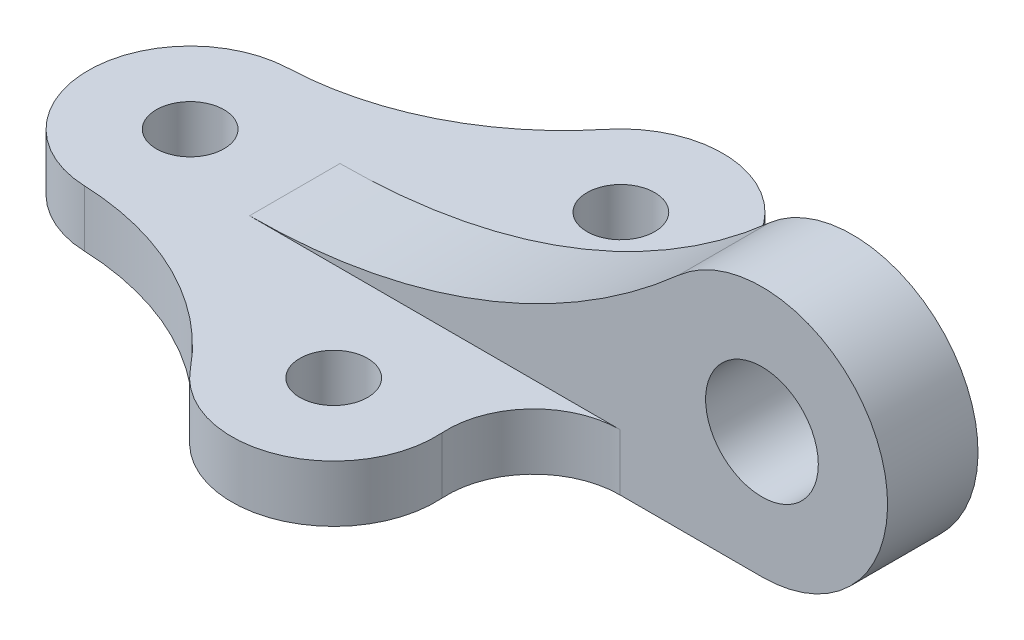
ISO-10303-21;
HEADER;
FILE_DESCRIPTION(('STEP AP214'),'2;1');
FILE_NAME('part.step','',(''),(''),'','','');
FILE_SCHEMA(('AUTOMOTIVE_DESIGN { 1 0 10303 214 1 1 1 1 }'));
ENDSEC;
DATA;
#1=APPLICATION_CONTEXT('core data for automotive mechanical design processes');
#2=APPLICATION_PROTOCOL_DEFINITION('international standard','automotive_design',2000,#1);
#3=PRODUCT_CONTEXT('',#1,'mechanical');
#4=PRODUCT('Part','Part','',(#3));
#5=PRODUCT_RELATED_PRODUCT_CATEGORY('part','',(#4));
#6=PRODUCT_DEFINITION_FORMATION('','',#4);
#7=PRODUCT_DEFINITION_CONTEXT('part definition',#1,'design');
#8=PRODUCT_DEFINITION('design','',#6,#7);
#9=PRODUCT_DEFINITION_SHAPE('','',#8);
#10=(LENGTH_UNIT() NAMED_UNIT(*) SI_UNIT(.MILLI.,.METRE.));
#11=(NAMED_UNIT(*) PLANE_ANGLE_UNIT() SI_UNIT($,.RADIAN.));
#12=(NAMED_UNIT(*) SI_UNIT($,.STERADIAN.) SOLID_ANGLE_UNIT());
#13=UNCERTAINTY_MEASURE_WITH_UNIT(LENGTH_MEASURE(1.E-05),#10,'distance_accuracy_value','');
#14=(GEOMETRIC_REPRESENTATION_CONTEXT(3) GLOBAL_UNCERTAINTY_ASSIGNED_CONTEXT((#13)) GLOBAL_UNIT_ASSIGNED_CONTEXT((#10,
#11,#12)) REPRESENTATION_CONTEXT('',''));
#15=CARTESIAN_POINT('',(0.,0.,0.));
#16=DIRECTION('',(0.,0.,1.));
#17=DIRECTION('',(1.,0.,0.));
#18=AXIS2_PLACEMENT_3D('',#15,#16,#17);
#19=CARTESIAN_POINT('',(-2.64164601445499,10.0076,-68.78329202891));
#20=DIRECTION('',(0.,1.,0.));
#21=DIRECTION('',(0.,0.,1.));
#22=AXIS2_PLACEMENT_3D('',#19,#20,#21);
#23=PLANE('',#22);
#24=DIRECTION('',(1.,0.,0.));
#25=VECTOR('',#24,1.);
#26=CARTESIAN_POINT('',(-2.64164601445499,10.0076,8.00099999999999));
#27=LINE('',#26,#25);
#28=CARTESIAN_POINT('',(18.5085183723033,10.0076,8.001));
#29=VERTEX_POINT('',#28);
#30=CARTESIAN_POINT('',(84.0038822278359,10.0076,8.001));
#31=VERTEX_POINT('',#30);
#32=EDGE_CURVE('E193',#29,#31,#27,.T.);
#33=ORIENTED_EDGE('',*,*,#32,.F.);
#34=DIRECTION('',(0.,0.,-1.));
#35=VECTOR('',#34,1.);
#36=CARTESIAN_POINT('',(18.5085183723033,10.0076,8.001));
#37=LINE('',#36,#35);
#38=CARTESIAN_POINT('',(18.5085183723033,10.0076,-8.001));
#39=VERTEX_POINT('',#38);
#40=EDGE_CURVE('E203',#29,#39,#37,.T.);
#41=ORIENTED_EDGE('',*,*,#40,.T.);
#42=DIRECTION('',(1.,0.,0.));
#43=VECTOR('',#42,1.);
#44=CARTESIAN_POINT('',(-2.64164601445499,10.0076,-8.001));
#45=LINE('',#44,#43);
#46=CARTESIAN_POINT('',(84.0038822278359,10.0076,-8.00099999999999));
#47=VERTEX_POINT('',#46);
#48=EDGE_CURVE('E208',#39,#47,#45,.T.);
#49=ORIENTED_EDGE('',*,*,#48,.T.);
#50=CARTESIAN_POINT('',(84.0038822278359,10.0076,-23.241));
#51=DIRECTION('',(0.,-1.,0.));
#52=DIRECTION('',(0.,0.,1.));
#53=AXIS2_PLACEMENT_3D('',#50,#51,#52);
#54=CIRCLE('',#53,15.24);
#55=CARTESIAN_POINT('',(68.7959972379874,10.0076,-24.2298549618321));
#56=VERTEX_POINT('',#55);
#57=EDGE_CURVE('E126',#47,#56,#54,.T.);
#58=ORIENTED_EDGE('',*,*,#57,.T.);
#59=CARTESIAN_POINT('',(50.8,10.0076,-25.4));
#60=DIRECTION('',(0.,1.,0.));
#61=DIRECTION('',(0.,0.,1.));
#62=AXIS2_PLACEMENT_3D('',#59,#60,#61);
#63=CIRCLE('',#62,18.034);
#64=CARTESIAN_POINT('',(36.7986831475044,10.0076,-36.7661023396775));
#65=VERTEX_POINT('',#64);
#66=EDGE_CURVE('E49',#56,#65,#63,.T.);
#67=ORIENTED_EDGE('',*,*,#66,.T.);
#68=CARTESIAN_POINT('',(-2.64164601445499,10.0076,-68.78329202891));
#69=DIRECTION('',(0.,-1.,0.));
#70=DIRECTION('',(0.,0.,1.));
#71=AXIS2_PLACEMENT_3D('',#68,#69,#70);
#72=CIRCLE('',#71,50.8);
#73=CARTESIAN_POINT('',(-0.69209176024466,10.0076,-18.020714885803));
#74=VERTEX_POINT('',#73);
#75=EDGE_CURVE('E146',#65,#74,#72,.T.);
#76=ORIENTED_EDGE('',*,*,#75,.T.);
#77=CARTESIAN_POINT('',(0.,10.0076,0.));
#78=DIRECTION('',(0.,1.,0.));
#79=DIRECTION('',(0.,0.,1.));
#80=AXIS2_PLACEMENT_3D('',#77,#78,#79);
#81=CIRCLE('',#80,18.034);
#82=CARTESIAN_POINT('',(-0.692091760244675,10.0076,18.020714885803));
#83=VERTEX_POINT('',#82);
#84=EDGE_CURVE('E90',#74,#83,#81,.T.);
#85=ORIENTED_EDGE('',*,*,#84,.T.);
#86=CARTESIAN_POINT('',(-2.64164601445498,10.0076,68.78329202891));
#87=DIRECTION('',(0.,-1.,0.));
#88=DIRECTION('',(0.,0.,-1.));
#89=AXIS2_PLACEMENT_3D('',#86,#87,#88);
#90=CIRCLE('',#89,50.8);
#91=CARTESIAN_POINT('',(36.7986831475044,10.0076,36.7661023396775));
#92=VERTEX_POINT('',#91);
#93=EDGE_CURVE('E108',#83,#92,#90,.T.);
#94=ORIENTED_EDGE('',*,*,#93,.T.);
#95=CARTESIAN_POINT('',(50.8,10.0076,25.4));
#96=DIRECTION('',(0.,1.,0.));
#97=DIRECTION('',(0.,0.,1.));
#98=AXIS2_PLACEMENT_3D('',#95,#96,#97);
#99=CIRCLE('',#98,18.034);
#100=CARTESIAN_POINT('',(68.7959972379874,10.0076,24.2298549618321));
#101=VERTEX_POINT('',#100);
#102=EDGE_CURVE('E100',#92,#101,#99,.T.);
#103=ORIENTED_EDGE('',*,*,#102,.T.);
#104=CARTESIAN_POINT('',(84.003882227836,10.0076,23.241));
#105=DIRECTION('',(0.,-1.,0.));
#106=DIRECTION('',(0.,0.,-1.));
#107=AXIS2_PLACEMENT_3D('',#104,#105,#106);
#108=CIRCLE('',#107,15.24);
#109=EDGE_CURVE('E105',#101,#31,#108,.T.);
#110=ORIENTED_EDGE('',*,*,#109,.T.);
#111=EDGE_LOOP('',(#33,#41,#49,#58,#67,#76,#85,#94,#103,#110));
#112=FACE_BOUND('',#111,.T.);
#113=CARTESIAN_POINT('',(0.,10.0076,0.));
#114=DIRECTION('',(0.,1.,0.));
#115=DIRECTION('',(0.,0.,1.));
#116=AXIS2_PLACEMENT_3D('',#113,#114,#115);
#117=CIRCLE('',#116,5.9944);
#118=CARTESIAN_POINT('',(0.,10.0076,5.9944));
#119=VERTEX_POINT('',#118);
#120=EDGE_CURVE('E221',#119,#119,#117,.T.);
#121=ORIENTED_EDGE('',*,*,#120,.F.);
#122=EDGE_LOOP('',(#121));
#123=FACE_BOUND('',#122,.T.);
#124=CARTESIAN_POINT('',(50.8,10.0076,-25.4));
#125=DIRECTION('',(0.,1.,0.));
#126=DIRECTION('',(0.,0.,1.));
#127=AXIS2_PLACEMENT_3D('',#124,#125,#126);
#128=CIRCLE('',#127,5.9944);
#129=CARTESIAN_POINT('',(50.8,10.0076,-19.4056));
#130=VERTEX_POINT('',#129);
#131=EDGE_CURVE('E137',#130,#130,#128,.T.);
#132=ORIENTED_EDGE('',*,*,#131,.F.);
#133=EDGE_LOOP('',(#132));
#134=FACE_BOUND('',#133,.T.);
#135=CARTESIAN_POINT('',(50.8,10.0076,25.4));
#136=DIRECTION('',(0.,1.,0.));
#137=DIRECTION('',(0.,0.,1.));
#138=AXIS2_PLACEMENT_3D('',#135,#136,#137);
#139=CIRCLE('',#138,5.9944);
#140=CARTESIAN_POINT('',(50.8,10.0076,31.3944));
#141=VERTEX_POINT('',#140);
#142=EDGE_CURVE('E214',#141,#141,#139,.T.);
#143=ORIENTED_EDGE('',*,*,#142,.F.);
#144=EDGE_LOOP('',(#143));
#145=FACE_BOUND('',#144,.T.);
#146=ADVANCED_FACE('F32',(#112,#123,#134,#145),#23,.T.);
#147=CARTESIAN_POINT('',(-2.64164601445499,0.,-68.78329202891));
#148=DIRECTION('',(0.,1.,0.));
#149=DIRECTION('',(0.,0.,1.));
#150=AXIS2_PLACEMENT_3D('',#147,#148,#149);
#151=PLANE('',#150);
#152=DIRECTION('',(1.,0.,0.));
#153=VECTOR('',#152,1.);
#154=CARTESIAN_POINT('',(109.162908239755,0.,8.001));
#155=LINE('',#154,#153);
#156=CARTESIAN_POINT('',(84.0038822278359,0.,8.001));
#157=VERTEX_POINT('',#156);
#158=CARTESIAN_POINT('',(109.162908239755,0.,8.001));
#159=VERTEX_POINT('',#158);
#160=EDGE_CURVE('E165',#157,#159,#155,.T.);
#161=ORIENTED_EDGE('',*,*,#160,.F.);
#162=CARTESIAN_POINT('',(84.003882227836,0.,23.241));
#163=DIRECTION('',(0.,-1.,0.));
#164=DIRECTION('',(0.,0.,-1.));
#165=AXIS2_PLACEMENT_3D('',#162,#163,#164);
#166=CIRCLE('',#165,15.24);
#167=CARTESIAN_POINT('',(68.7959972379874,0.,24.2298549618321));
#168=VERTEX_POINT('',#167);
#169=EDGE_CURVE('E142',#168,#157,#166,.T.);
#170=ORIENTED_EDGE('',*,*,#169,.F.);
#171=CARTESIAN_POINT('',(50.8,0.,25.4));
#172=DIRECTION('',(0.,1.,0.));
#173=DIRECTION('',(0.,0.,1.));
#174=AXIS2_PLACEMENT_3D('',#171,#172,#173);
#175=CIRCLE('',#174,18.034);
#176=CARTESIAN_POINT('',(36.7986831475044,0.,36.7661023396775));
#177=VERTEX_POINT('',#176);
#178=EDGE_CURVE('E117',#177,#168,#175,.T.);
#179=ORIENTED_EDGE('',*,*,#178,.F.);
#180=CARTESIAN_POINT('',(-2.64164601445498,0.,68.78329202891));
#181=DIRECTION('',(0.,-1.,0.));
#182=DIRECTION('',(0.,0.,-1.));
#183=AXIS2_PLACEMENT_3D('',#180,#181,#182);
#184=CIRCLE('',#183,50.8);
#185=CARTESIAN_POINT('',(-0.692091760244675,0.,18.020714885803));
#186=VERTEX_POINT('',#185);
#187=EDGE_CURVE('E139',#186,#177,#184,.T.);
#188=ORIENTED_EDGE('',*,*,#187,.F.);
#189=CARTESIAN_POINT('',(0.,0.,0.));
#190=DIRECTION('',(0.,1.,0.));
#191=DIRECTION('',(0.,0.,1.));
#192=AXIS2_PLACEMENT_3D('',#189,#190,#191);
#193=CIRCLE('',#192,18.034);
#194=CARTESIAN_POINT('',(-0.69209176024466,0.,-18.020714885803));
#195=VERTEX_POINT('',#194);
#196=EDGE_CURVE('E136',#195,#186,#193,.T.);
#197=ORIENTED_EDGE('',*,*,#196,.F.);
#198=CARTESIAN_POINT('',(-2.64164601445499,0.,-68.78329202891));
#199=DIRECTION('',(0.,-1.,0.));
#200=DIRECTION('',(0.,0.,1.));
#201=AXIS2_PLACEMENT_3D('',#198,#199,#200);
#202=CIRCLE('',#201,50.8);
#203=CARTESIAN_POINT('',(36.7986831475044,0.,-36.7661023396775));
#204=VERTEX_POINT('',#203);
#205=EDGE_CURVE('E133',#204,#195,#202,.T.);
#206=ORIENTED_EDGE('',*,*,#205,.F.);
#207=CARTESIAN_POINT('',(50.8,0.,-25.4));
#208=DIRECTION('',(0.,1.,0.));
#209=DIRECTION('',(0.,0.,1.));
#210=AXIS2_PLACEMENT_3D('',#207,#208,#209);
#211=CIRCLE('',#210,18.034);
#212=CARTESIAN_POINT('',(68.7959972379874,0.,-24.2298549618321));
#213=VERTEX_POINT('',#212);
#214=EDGE_CURVE('E82',#213,#204,#211,.T.);
#215=ORIENTED_EDGE('',*,*,#214,.F.);
#216=CARTESIAN_POINT('',(84.0038822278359,0.,-23.241));
#217=DIRECTION('',(0.,-1.,0.));
#218=DIRECTION('',(0.,0.,1.));
#219=AXIS2_PLACEMENT_3D('',#216,#217,#218);
#220=CIRCLE('',#219,15.24);
#221=CARTESIAN_POINT('',(84.0038822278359,0.,-8.00099999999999));
#222=VERTEX_POINT('',#221);
#223=EDGE_CURVE('E76',#222,#213,#220,.T.);
#224=ORIENTED_EDGE('',*,*,#223,.F.);
#225=DIRECTION('',(1.,0.,0.));
#226=VECTOR('',#225,1.);
#227=CARTESIAN_POINT('',(109.162908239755,0.,-8.001));
#228=LINE('',#227,#226);
#229=CARTESIAN_POINT('',(109.162908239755,0.,-8.001));
#230=VERTEX_POINT('',#229);
#231=EDGE_CURVE('E410',#222,#230,#228,.T.);
#232=ORIENTED_EDGE('',*,*,#231,.T.);
#233=DIRECTION('',(0.,0.,-1.));
#234=VECTOR('',#233,1.);
#235=CARTESIAN_POINT('',(109.162908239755,0.,8.001));
#236=LINE('',#235,#234);
#237=EDGE_CURVE('E209',#159,#230,#236,.T.);
#238=ORIENTED_EDGE('',*,*,#237,.F.);
#239=EDGE_LOOP('',(#161,#170,#179,#188,#197,#206,#215,#224,#232,#238));
#240=FACE_BOUND('',#239,.T.);
#241=CARTESIAN_POINT('',(0.,0.,0.));
#242=DIRECTION('',(0.,1.,0.));
#243=DIRECTION('',(0.,0.,1.));
#244=AXIS2_PLACEMENT_3D('',#241,#242,#243);
#245=CIRCLE('',#244,5.9944);
#246=CARTESIAN_POINT('',(0.,0.,5.9944));
#247=VERTEX_POINT('',#246);
#248=EDGE_CURVE('E219',#247,#247,#245,.T.);
#249=ORIENTED_EDGE('',*,*,#248,.T.);
#250=EDGE_LOOP('',(#249));
#251=FACE_BOUND('',#250,.T.);
#252=CARTESIAN_POINT('',(50.8,0.,-25.4));
#253=DIRECTION('',(0.,1.,0.));
#254=DIRECTION('',(0.,0.,1.));
#255=AXIS2_PLACEMENT_3D('',#252,#253,#254);
#256=CIRCLE('',#255,5.9944);
#257=CARTESIAN_POINT('',(50.8,0.,-19.4056));
#258=VERTEX_POINT('',#257);
#259=EDGE_CURVE('E224',#258,#258,#256,.T.);
#260=ORIENTED_EDGE('',*,*,#259,.T.);
#261=EDGE_LOOP('',(#260));
#262=FACE_BOUND('',#261,.T.);
#263=CARTESIAN_POINT('',(50.8,0.,25.4));
#264=DIRECTION('',(0.,1.,0.));
#265=DIRECTION('',(0.,0.,1.));
#266=AXIS2_PLACEMENT_3D('',#263,#264,#265);
#267=CIRCLE('',#266,5.9944);
#268=CARTESIAN_POINT('',(50.8,0.,31.3944));
#269=VERTEX_POINT('',#268);
#270=EDGE_CURVE('E211',#269,#269,#267,.T.);
#271=ORIENTED_EDGE('',*,*,#270,.T.);
#272=EDGE_LOOP('',(#271));
#273=FACE_BOUND('',#272,.T.);
#274=ADVANCED_FACE('F159',(#240,#251,#262,#273),#151,.F.);
#275=CARTESIAN_POINT('',(-2.64164601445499,10.0076,-68.78329202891));
#276=DIRECTION('',(0.,-1.,0.));
#277=DIRECTION('',(0.,0.,-1.));
#278=AXIS2_PLACEMENT_3D('',#275,#276,#277);
#279=CYLINDRICAL_SURFACE('',#278,50.8);
#280=ORIENTED_EDGE('',*,*,#205,.T.);
#281=DIRECTION('',(0.,-1.,0.));
#282=VECTOR('',#281,1.);
#283=CARTESIAN_POINT('',(-0.69209176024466,10.0076,-18.020714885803));
#284=LINE('',#283,#282);
#285=EDGE_CURVE('E11',#74,#195,#284,.T.);
#286=ORIENTED_EDGE('',*,*,#285,.F.);
#287=ORIENTED_EDGE('',*,*,#75,.F.);
#288=DIRECTION('',(0.,-1.,0.));
#289=VECTOR('',#288,1.);
#290=CARTESIAN_POINT('',(36.7986831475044,10.0076,-36.7661023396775));
#291=LINE('',#290,#289);
#292=EDGE_CURVE('E132',#65,#204,#291,.T.);
#293=ORIENTED_EDGE('',*,*,#292,.T.);
#294=EDGE_LOOP('',(#280,#286,#287,#293));
#295=FACE_BOUND('',#294,.T.);
#296=ADVANCED_FACE('F34',(#295),#279,.F.);
#297=CARTESIAN_POINT('',(0.,10.0076,0.));
#298=DIRECTION('',(0.,-1.,0.));
#299=DIRECTION('',(0.,0.,-1.));
#300=AXIS2_PLACEMENT_3D('',#297,#298,#299);
#301=CYLINDRICAL_SURFACE('',#300,18.034);
#302=ORIENTED_EDGE('',*,*,#196,.T.);
#303=DIRECTION('',(0.,-1.,0.));
#304=VECTOR('',#303,1.);
#305=CARTESIAN_POINT('',(-0.692091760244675,10.0076,18.020714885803));
#306=LINE('',#305,#304);
#307=EDGE_CURVE('E41',#83,#186,#306,.T.);
#308=ORIENTED_EDGE('',*,*,#307,.F.);
#309=ORIENTED_EDGE('',*,*,#84,.F.);
#310=ORIENTED_EDGE('',*,*,#285,.T.);
#311=EDGE_LOOP('',(#302,#308,#309,#310));
#312=FACE_BOUND('',#311,.T.);
#313=ADVANCED_FACE('F235',(#312),#301,.T.);
#314=CARTESIAN_POINT('',(-2.64164601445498,10.0076,68.78329202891));
#315=DIRECTION('',(0.,-1.,0.));
#316=DIRECTION('',(0.,0.,-1.));
#317=AXIS2_PLACEMENT_3D('',#314,#315,#316);
#318=CYLINDRICAL_SURFACE('',#317,50.8);
#319=ORIENTED_EDGE('',*,*,#187,.T.);
#320=DIRECTION('',(0.,-1.,0.));
#321=VECTOR('',#320,1.);
#322=CARTESIAN_POINT('',(36.7986831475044,10.0076,36.7661023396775));
#323=LINE('',#322,#321);
#324=EDGE_CURVE('E121',#92,#177,#323,.T.);
#325=ORIENTED_EDGE('',*,*,#324,.F.);
#326=ORIENTED_EDGE('',*,*,#93,.F.);
#327=ORIENTED_EDGE('',*,*,#307,.T.);
#328=EDGE_LOOP('',(#319,#325,#326,#327));
#329=FACE_BOUND('',#328,.T.);
#330=ADVANCED_FACE('F156',(#329),#318,.F.);
#331=CARTESIAN_POINT('',(50.8,10.0076,25.4));
#332=DIRECTION('',(0.,-1.,0.));
#333=DIRECTION('',(0.,0.,-1.));
#334=AXIS2_PLACEMENT_3D('',#331,#332,#333);
#335=CYLINDRICAL_SURFACE('',#334,18.034);
#336=ORIENTED_EDGE('',*,*,#178,.T.);
#337=DIRECTION('',(0.,-1.,0.));
#338=VECTOR('',#337,1.);
#339=CARTESIAN_POINT('',(68.7959972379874,10.0076,24.2298549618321));
#340=LINE('',#339,#338);
#341=EDGE_CURVE('E114',#101,#168,#340,.T.);
#342=ORIENTED_EDGE('',*,*,#341,.F.);
#343=ORIENTED_EDGE('',*,*,#102,.F.);
#344=ORIENTED_EDGE('',*,*,#324,.T.);
#345=EDGE_LOOP('',(#336,#342,#343,#344));
#346=FACE_BOUND('',#345,.T.);
#347=ADVANCED_FACE('F115',(#346),#335,.T.);
#348=CARTESIAN_POINT('',(84.003882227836,10.0076,23.241));
#349=DIRECTION('',(0.,-1.,0.));
#350=DIRECTION('',(0.,0.,-1.));
#351=AXIS2_PLACEMENT_3D('',#348,#349,#350);
#352=CYLINDRICAL_SURFACE('',#351,15.24);
#353=ORIENTED_EDGE('',*,*,#169,.T.);
#354=DIRECTION('',(0.,-1.,0.));
#355=VECTOR('',#354,1.);
#356=CARTESIAN_POINT('',(84.0038822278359,10.0076,8.00099999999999));
#357=LINE('',#356,#355);
#358=EDGE_CURVE('E122',#31,#157,#357,.T.);
#359=ORIENTED_EDGE('',*,*,#358,.F.);
#360=ORIENTED_EDGE('',*,*,#109,.F.);
#361=ORIENTED_EDGE('',*,*,#341,.T.);
#362=EDGE_LOOP('',(#353,#359,#360,#361));
#363=FACE_BOUND('',#362,.T.);
#364=ADVANCED_FACE('F124',(#363),#352,.F.);
#365=CARTESIAN_POINT('',(84.0038822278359,10.0076,-23.241));
#366=DIRECTION('',(0.,-1.,0.));
#367=DIRECTION('',(0.,0.,-1.));
#368=AXIS2_PLACEMENT_3D('',#365,#366,#367);
#369=CYLINDRICAL_SURFACE('',#368,15.24);
#370=ORIENTED_EDGE('',*,*,#223,.T.);
#371=DIRECTION('',(0.,-1.,0.));
#372=VECTOR('',#371,1.);
#373=CARTESIAN_POINT('',(68.7959972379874,10.0076,-24.2298549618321));
#374=LINE('',#373,#372);
#375=EDGE_CURVE('E148',#56,#213,#374,.T.);
#376=ORIENTED_EDGE('',*,*,#375,.F.);
#377=ORIENTED_EDGE('',*,*,#57,.F.);
#378=DIRECTION('',(0.,-1.,0.));
#379=VECTOR('',#378,1.);
#380=CARTESIAN_POINT('',(84.0038822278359,10.0076,-8.00099999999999));
#381=LINE('',#380,#379);
#382=EDGE_CURVE('E150',#47,#222,#381,.T.);
#383=ORIENTED_EDGE('',*,*,#382,.T.);
#384=EDGE_LOOP('',(#370,#376,#377,#383));
#385=FACE_BOUND('',#384,.T.);
#386=ADVANCED_FACE('F255',(#385),#369,.F.);
#387=CARTESIAN_POINT('',(50.8,10.0076,-25.4));
#388=DIRECTION('',(0.,-1.,0.));
#389=DIRECTION('',(0.,0.,-1.));
#390=AXIS2_PLACEMENT_3D('',#387,#388,#389);
#391=CYLINDRICAL_SURFACE('',#390,18.034);
#392=ORIENTED_EDGE('',*,*,#214,.T.);
#393=ORIENTED_EDGE('',*,*,#292,.F.);
#394=ORIENTED_EDGE('',*,*,#66,.F.);
#395=ORIENTED_EDGE('',*,*,#375,.T.);
#396=EDGE_LOOP('',(#392,#393,#394,#395));
#397=FACE_BOUND('',#396,.T.);
#398=ADVANCED_FACE('F252',(#397),#391,.T.);
#399=CARTESIAN_POINT('',(50.8,10.0076,-25.4));
#400=DIRECTION('',(0.,-1.,0.));
#401=DIRECTION('',(0.,0.,-1.));
#402=AXIS2_PLACEMENT_3D('',#399,#400,#401);
#403=CYLINDRICAL_SURFACE('',#402,5.9944);
#404=ORIENTED_EDGE('',*,*,#131,.T.);
#405=EDGE_LOOP('',(#404));
#406=FACE_BOUND('',#405,.T.);
#407=ORIENTED_EDGE('',*,*,#259,.F.);
#408=EDGE_LOOP('',(#407));
#409=FACE_BOUND('',#408,.T.);
#410=ADVANCED_FACE('F249',(#406,#409),#403,.F.);
#411=CARTESIAN_POINT('',(0.,10.0076,0.));
#412=DIRECTION('',(0.,-1.,0.));
#413=DIRECTION('',(0.,0.,-1.));
#414=AXIS2_PLACEMENT_3D('',#411,#412,#413);
#415=CYLINDRICAL_SURFACE('',#414,5.9944);
#416=ORIENTED_EDGE('',*,*,#120,.T.);
#417=EDGE_LOOP('',(#416));
#418=FACE_BOUND('',#417,.T.);
#419=ORIENTED_EDGE('',*,*,#248,.F.);
#420=EDGE_LOOP('',(#419));
#421=FACE_BOUND('',#420,.T.);
#422=ADVANCED_FACE('F286',(#418,#421),#415,.F.);
#423=CARTESIAN_POINT('',(50.8,10.0076,25.4));
#424=DIRECTION('',(0.,-1.,0.));
#425=DIRECTION('',(0.,0.,-1.));
#426=AXIS2_PLACEMENT_3D('',#423,#424,#425);
#427=CYLINDRICAL_SURFACE('',#426,5.9944);
#428=ORIENTED_EDGE('',*,*,#142,.T.);
#429=EDGE_LOOP('',(#428));
#430=FACE_BOUND('',#429,.T.);
#431=ORIENTED_EDGE('',*,*,#270,.F.);
#432=EDGE_LOOP('',(#431));
#433=FACE_BOUND('',#432,.T.);
#434=ADVANCED_FACE('F292',(#430,#433),#427,.F.);
#435=CARTESIAN_POINT('',(18.5085183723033,124.3076,8.001));
#436=DIRECTION('',(0.,0.,1.));
#437=DIRECTION('',(1.,0.,0.));
#438=AXIS2_PLACEMENT_3D('',#435,#436,#437);
#439=PLANE('',#438);
#440=CARTESIAN_POINT('',(18.5085183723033,124.3076,8.001));
#441=DIRECTION('',(0.,0.,-1.));
#442=DIRECTION('',(1.,0.,0.));
#443=AXIS2_PLACEMENT_3D('',#440,#441,#442);
#444=CIRCLE('',#443,114.3);
#445=CARTESIAN_POINT('',(94.4052168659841,38.8430976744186,8.001));
#446=VERTEX_POINT('',#445);
#447=EDGE_CURVE('E189',#446,#29,#444,.T.);
#448=ORIENTED_EDGE('',*,*,#447,.T.);
#449=ORIENTED_EDGE('',*,*,#32,.T.);
#450=ORIENTED_EDGE('',*,*,#358,.T.);
#451=ORIENTED_EDGE('',*,*,#160,.T.);
#452=CARTESIAN_POINT('',(109.162908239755,22.225,8.001));
#453=DIRECTION('',(0.,0.,1.));
#454=DIRECTION('',(-1.,0.,0.));
#455=AXIS2_PLACEMENT_3D('',#452,#453,#454);
#456=CIRCLE('',#455,22.225);
#457=EDGE_CURVE('E195',#159,#446,#456,.T.);
#458=ORIENTED_EDGE('',*,*,#457,.T.);
#459=EDGE_LOOP('',(#448,#449,#450,#451,#458));
#460=FACE_BOUND('',#459,.T.);
#461=CARTESIAN_POINT('',(109.162908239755,22.225,8.001));
#462=DIRECTION('',(0.,0.,1.));
#463=DIRECTION('',(1.,0.,0.));
#464=AXIS2_PLACEMENT_3D('',#461,#462,#463);
#465=CIRCLE('',#464,9.9695);
#466=CARTESIAN_POINT('',(119.132408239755,22.225,8.001));
#467=VERTEX_POINT('',#466);
#468=EDGE_CURVE('E398',#467,#467,#465,.T.);
#469=ORIENTED_EDGE('',*,*,#468,.F.);
#470=EDGE_LOOP('',(#469));
#471=FACE_BOUND('',#470,.T.);
#472=ADVANCED_FACE('F191',(#460,#471),#439,.T.);
#473=CARTESIAN_POINT('',(18.5085183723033,124.3076,-8.001));
#474=DIRECTION('',(0.,0.,1.));
#475=DIRECTION('',(1.,0.,0.));
#476=AXIS2_PLACEMENT_3D('',#473,#474,#475);
#477=PLANE('',#476);
#478=ORIENTED_EDGE('',*,*,#48,.F.);
#479=CARTESIAN_POINT('',(18.5085183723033,124.3076,-8.001));
#480=DIRECTION('',(0.,0.,-1.));
#481=DIRECTION('',(1.,0.,0.));
#482=AXIS2_PLACEMENT_3D('',#479,#480,#481);
#483=CIRCLE('',#482,114.3);
#484=CARTESIAN_POINT('',(94.4052168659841,38.8430976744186,-8.001));
#485=VERTEX_POINT('',#484);
#486=EDGE_CURVE('E206',#485,#39,#483,.T.);
#487=ORIENTED_EDGE('',*,*,#486,.F.);
#488=CARTESIAN_POINT('',(109.162908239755,22.225,-8.001));
#489=DIRECTION('',(0.,0.,1.));
#490=DIRECTION('',(-1.,0.,0.));
#491=AXIS2_PLACEMENT_3D('',#488,#489,#490);
#492=CIRCLE('',#491,22.225);
#493=EDGE_CURVE('E199',#230,#485,#492,.T.);
#494=ORIENTED_EDGE('',*,*,#493,.F.);
#495=ORIENTED_EDGE('',*,*,#231,.F.);
#496=ORIENTED_EDGE('',*,*,#382,.F.);
#497=EDGE_LOOP('',(#478,#487,#494,#495,#496));
#498=FACE_BOUND('',#497,.T.);
#499=CARTESIAN_POINT('',(109.162908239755,22.225,-8.001));
#500=DIRECTION('',(0.,0.,1.));
#501=DIRECTION('',(1.,0.,0.));
#502=AXIS2_PLACEMENT_3D('',#499,#500,#501);
#503=CIRCLE('',#502,9.9695);
#504=CARTESIAN_POINT('',(119.132408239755,22.225,-8.001));
#505=VERTEX_POINT('',#504);
#506=EDGE_CURVE('E401',#505,#505,#503,.T.);
#507=ORIENTED_EDGE('',*,*,#506,.T.);
#508=EDGE_LOOP('',(#507));
#509=FACE_BOUND('',#508,.T.);
#510=ADVANCED_FACE('F306',(#498,#509),#477,.F.);
#511=CARTESIAN_POINT('',(18.5085183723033,124.3076,8.001));
#512=DIRECTION('',(0.,0.,-1.));
#513=DIRECTION('',(-1.,0.,0.));
#514=AXIS2_PLACEMENT_3D('',#511,#512,#513);
#515=CYLINDRICAL_SURFACE('',#514,114.3);
#516=ORIENTED_EDGE('',*,*,#486,.T.);
#517=ORIENTED_EDGE('',*,*,#40,.F.);
#518=ORIENTED_EDGE('',*,*,#447,.F.);
#519=DIRECTION('',(0.,0.,-1.));
#520=VECTOR('',#519,1.);
#521=CARTESIAN_POINT('',(94.4052168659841,38.8430976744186,8.001));
#522=LINE('',#521,#520);
#523=EDGE_CURVE('E408',#446,#485,#522,.T.);
#524=ORIENTED_EDGE('',*,*,#523,.T.);
#525=EDGE_LOOP('',(#516,#517,#518,#524));
#526=FACE_BOUND('',#525,.T.);
#527=ADVANCED_FACE('F204',(#526),#515,.F.);
#528=CARTESIAN_POINT('',(109.162908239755,22.225,8.001));
#529=DIRECTION('',(0.,0.,-1.));
#530=DIRECTION('',(-1.,0.,0.));
#531=AXIS2_PLACEMENT_3D('',#528,#529,#530);
#532=CYLINDRICAL_SURFACE('',#531,22.225);
#533=ORIENTED_EDGE('',*,*,#493,.T.);
#534=ORIENTED_EDGE('',*,*,#523,.F.);
#535=ORIENTED_EDGE('',*,*,#457,.F.);
#536=ORIENTED_EDGE('',*,*,#237,.T.);
#537=EDGE_LOOP('',(#533,#534,#535,#536));
#538=FACE_BOUND('',#537,.T.);
#539=ADVANCED_FACE('F320',(#538),#532,.T.);
#540=CARTESIAN_POINT('',(109.162908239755,22.225,8.001));
#541=DIRECTION('',(0.,0.,-1.));
#542=DIRECTION('',(-1.,0.,0.));
#543=AXIS2_PLACEMENT_3D('',#540,#541,#542);
#544=CYLINDRICAL_SURFACE('',#543,9.9695);
#545=ORIENTED_EDGE('',*,*,#468,.T.);
#546=EDGE_LOOP('',(#545));
#547=FACE_BOUND('',#546,.T.);
#548=ORIENTED_EDGE('',*,*,#506,.F.);
#549=EDGE_LOOP('',(#548));
#550=FACE_BOUND('',#549,.T.);
#551=ADVANCED_FACE('F327',(#547,#550),#544,.F.);
#552=CLOSED_SHELL('',(#146,#274,#296,#313,#330,#347,#364,#386,#398,#410,#422,#434,#472,#510,
#527,#539,#551));
#553=MANIFOLD_SOLID_BREP('B2',#552);
#554=ADVANCED_BREP_SHAPE_REPRESENTATION('',(#18,#553),#14);
#555=SHAPE_DEFINITION_REPRESENTATION(#9,#554);
ENDSEC;
END-ISO-10303-21;
